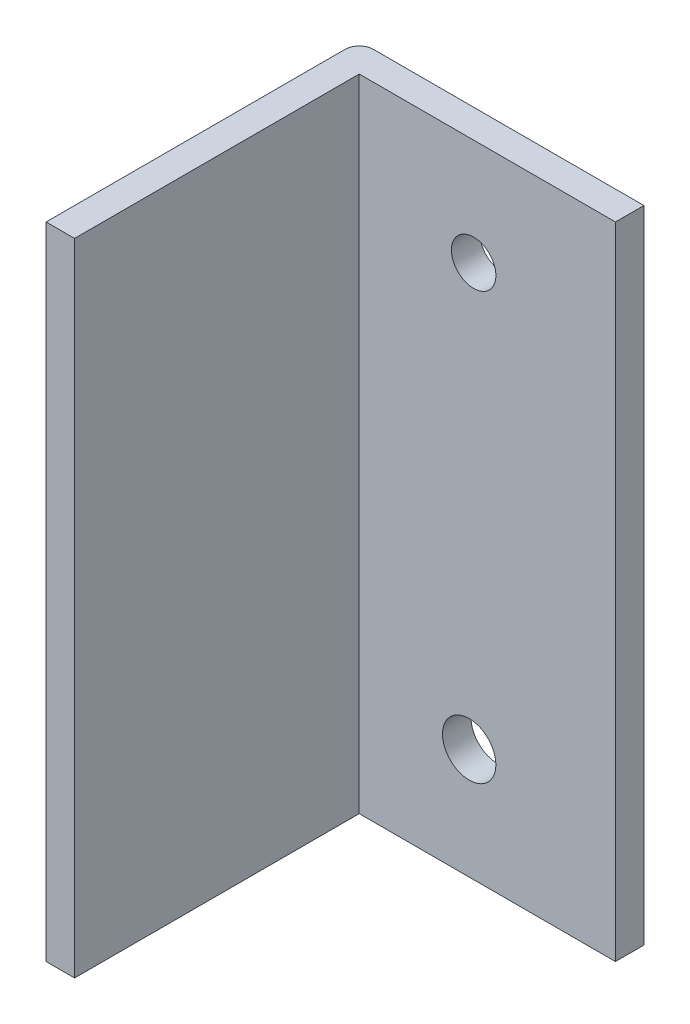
ISO-10303-21;
HEADER;
FILE_DESCRIPTION(('STEP AP214'),'2;1');
FILE_NAME('part.step','',(''),(''),'','','');
FILE_SCHEMA(('AUTOMOTIVE_DESIGN { 1 0 10303 214 1 1 1 1 }'));
ENDSEC;
DATA;
#1=APPLICATION_CONTEXT('core data for automotive mechanical design processes');
#2=APPLICATION_PROTOCOL_DEFINITION('international standard','automotive_design',2000,#1);
#3=PRODUCT_CONTEXT('',#1,'mechanical');
#4=PRODUCT('Part','Part','',(#3));
#5=PRODUCT_RELATED_PRODUCT_CATEGORY('part','',(#4));
#6=PRODUCT_DEFINITION_FORMATION('','',#4);
#7=PRODUCT_DEFINITION_CONTEXT('part definition',#1,'design');
#8=PRODUCT_DEFINITION('design','',#6,#7);
#9=PRODUCT_DEFINITION_SHAPE('','',#8);
#10=(LENGTH_UNIT() NAMED_UNIT(*) SI_UNIT(.MILLI.,.METRE.));
#11=(NAMED_UNIT(*) PLANE_ANGLE_UNIT() SI_UNIT($,.RADIAN.));
#12=(NAMED_UNIT(*) SI_UNIT($,.STERADIAN.) SOLID_ANGLE_UNIT());
#13=UNCERTAINTY_MEASURE_WITH_UNIT(LENGTH_MEASURE(1.E-05),#10,'distance_accuracy_value','');
#14=(GEOMETRIC_REPRESENTATION_CONTEXT(3) GLOBAL_UNCERTAINTY_ASSIGNED_CONTEXT((#13)) GLOBAL_UNIT_ASSIGNED_CONTEXT((#10,
#11,#12)) REPRESENTATION_CONTEXT('',''));
#15=CARTESIAN_POINT('',(0.,0.,0.));
#16=DIRECTION('',(0.,0.,1.));
#17=DIRECTION('',(1.,0.,0.));
#18=AXIS2_PLACEMENT_3D('',#15,#16,#17);
#19=CARTESIAN_POINT('',(25.4,-57.15,5.08));
#20=DIRECTION('',(-1.,0.,0.));
#21=DIRECTION('',(0.,0.,1.));
#22=AXIS2_PLACEMENT_3D('',#19,#20,#21);
#23=PLANE('',#22);
#24=DIRECTION('',(0.,1.,0.));
#25=VECTOR('',#24,1.);
#26=CARTESIAN_POINT('',(25.4,-57.15,0.));
#27=LINE('',#26,#25);
#28=CARTESIAN_POINT('',(25.4,-57.15,0.));
#29=VERTEX_POINT('',#28);
#30=CARTESIAN_POINT('',(25.4,57.15,0.));
#31=VERTEX_POINT('',#30);
#32=EDGE_CURVE('E120',#29,#31,#27,.T.);
#33=ORIENTED_EDGE('',*,*,#32,.T.);
#34=DIRECTION('',(0.,0.,-1.));
#35=VECTOR('',#34,1.);
#36=CARTESIAN_POINT('',(25.4,57.15,5.08));
#37=LINE('',#36,#35);
#38=CARTESIAN_POINT('',(25.4,57.15,5.08));
#39=VERTEX_POINT('',#38);
#40=EDGE_CURVE('E143',#39,#31,#37,.T.);
#41=ORIENTED_EDGE('',*,*,#40,.F.);
#42=DIRECTION('',(0.,1.,0.));
#43=VECTOR('',#42,1.);
#44=CARTESIAN_POINT('',(25.4,-57.15,5.08));
#45=LINE('',#44,#43);
#46=CARTESIAN_POINT('',(25.4,-57.15,5.08));
#47=VERTEX_POINT('',#46);
#48=EDGE_CURVE('E122',#47,#39,#45,.T.);
#49=ORIENTED_EDGE('',*,*,#48,.F.);
#50=DIRECTION('',(0.,0.,-1.));
#51=VECTOR('',#50,1.);
#52=CARTESIAN_POINT('',(25.4,-57.15,5.08));
#53=LINE('',#52,#51);
#54=EDGE_CURVE('E130',#47,#29,#53,.T.);
#55=ORIENTED_EDGE('',*,*,#54,.T.);
#56=EDGE_LOOP('',(#33,#41,#49,#55));
#57=FACE_BOUND('',#56,.T.);
#58=ADVANCED_FACE('F32',(#57),#23,.F.);
#59=CARTESIAN_POINT('',(-25.4,57.15,5.08));
#60=DIRECTION('',(0.,-1.,0.));
#61=DIRECTION('',(0.,0.,-1.));
#62=AXIS2_PLACEMENT_3D('',#59,#60,#61);
#63=PLANE('',#62);
#64=DIRECTION('',(-1.,0.,0.));
#65=VECTOR('',#64,1.);
#66=CARTESIAN_POINT('',(-25.4,57.15,0.));
#67=LINE('',#66,#65);
#68=CARTESIAN_POINT('',(-22.86,57.15,0.));
#69=VERTEX_POINT('',#68);
#70=EDGE_CURVE('E133',#31,#69,#67,.T.);
#71=ORIENTED_EDGE('',*,*,#70,.T.);
#72=CARTESIAN_POINT('',(-22.86,57.15,2.54));
#73=DIRECTION('',(0.,-1.,0.));
#74=DIRECTION('',(0.,0.,-1.));
#75=AXIS2_PLACEMENT_3D('',#72,#73,#74);
#76=CIRCLE('',#75,2.54);
#77=CARTESIAN_POINT('',(-25.4,57.15,2.54));
#78=VERTEX_POINT('',#77);
#79=EDGE_CURVE('E11',#69,#78,#76,.F.);
#80=ORIENTED_EDGE('',*,*,#79,.T.);
#81=DIRECTION('',(0.,0.,-1.));
#82=VECTOR('',#81,1.);
#83=CARTESIAN_POINT('',(-25.4,57.15,5.08));
#84=LINE('',#83,#82);
#85=CARTESIAN_POINT('',(-25.4,57.15,55.88));
#86=VERTEX_POINT('',#85);
#87=EDGE_CURVE('E140',#86,#78,#84,.T.);
#88=ORIENTED_EDGE('',*,*,#87,.F.);
#89=DIRECTION('',(-1.,0.,0.));
#90=VECTOR('',#89,1.);
#91=CARTESIAN_POINT('',(-20.32,57.15,55.88));
#92=LINE('',#91,#90);
#93=CARTESIAN_POINT('',(-20.32,57.15,55.88));
#94=VERTEX_POINT('',#93);
#95=EDGE_CURVE('E99',#94,#86,#92,.T.);
#96=ORIENTED_EDGE('',*,*,#95,.F.);
#97=DIRECTION('',(0.,0.,-1.));
#98=VECTOR('',#97,1.);
#99=CARTESIAN_POINT('',(-20.32,57.15,5.08));
#100=LINE('',#99,#98);
#101=CARTESIAN_POINT('',(-20.32,57.15,5.08));
#102=VERTEX_POINT('',#101);
#103=EDGE_CURVE('E100',#94,#102,#100,.T.);
#104=ORIENTED_EDGE('',*,*,#103,.T.);
#105=DIRECTION('',(-1.,0.,0.));
#106=VECTOR('',#105,1.);
#107=CARTESIAN_POINT('',(-25.4,57.15,5.08));
#108=LINE('',#107,#106);
#109=EDGE_CURVE('E125',#39,#102,#108,.T.);
#110=ORIENTED_EDGE('',*,*,#109,.F.);
#111=ORIENTED_EDGE('',*,*,#40,.T.);
#112=EDGE_LOOP('',(#71,#80,#88,#96,#104,#110,#111));
#113=FACE_BOUND('',#112,.T.);
#114=ADVANCED_FACE('F155',(#113),#63,.F.);
#115=CARTESIAN_POINT('',(-25.4,-57.15,5.08));
#116=DIRECTION('',(1.,0.,0.));
#117=DIRECTION('',(0.,0.,-1.));
#118=AXIS2_PLACEMENT_3D('',#115,#116,#117);
#119=PLANE('',#118);
#120=ORIENTED_EDGE('',*,*,#87,.T.);
#121=DIRECTION('',(0.,-1.,0.));
#122=VECTOR('',#121,1.);
#123=CARTESIAN_POINT('',(-25.4,-57.15,2.54));
#124=LINE('',#123,#122);
#125=CARTESIAN_POINT('',(-25.4,-57.15,2.54));
#126=VERTEX_POINT('',#125);
#127=EDGE_CURVE('E146',#78,#126,#124,.T.);
#128=ORIENTED_EDGE('',*,*,#127,.T.);
#129=DIRECTION('',(0.,0.,-1.));
#130=VECTOR('',#129,1.);
#131=CARTESIAN_POINT('',(-25.4,-57.15,5.08));
#132=LINE('',#131,#130);
#133=CARTESIAN_POINT('',(-25.4,-57.15,55.88));
#134=VERTEX_POINT('',#133);
#135=EDGE_CURVE('E138',#134,#126,#132,.T.);
#136=ORIENTED_EDGE('',*,*,#135,.F.);
#137=DIRECTION('',(0.,1.,0.));
#138=VECTOR('',#137,1.);
#139=CARTESIAN_POINT('',(-25.4,57.15,55.88));
#140=LINE('',#139,#138);
#141=EDGE_CURVE('E97',#134,#86,#140,.T.);
#142=ORIENTED_EDGE('',*,*,#141,.T.);
#143=EDGE_LOOP('',(#120,#128,#136,#142));
#144=FACE_BOUND('',#143,.T.);
#145=ADVANCED_FACE('F151',(#144),#119,.F.);
#146=CARTESIAN_POINT('',(-25.4,-57.15,5.08));
#147=DIRECTION('',(0.,1.,0.));
#148=DIRECTION('',(0.,0.,1.));
#149=AXIS2_PLACEMENT_3D('',#146,#147,#148);
#150=PLANE('',#149);
#151=ORIENTED_EDGE('',*,*,#135,.T.);
#152=CARTESIAN_POINT('',(-22.86,-57.15,2.54));
#153=DIRECTION('',(0.,1.,0.));
#154=DIRECTION('',(0.,0.,1.));
#155=AXIS2_PLACEMENT_3D('',#152,#153,#154);
#156=CIRCLE('',#155,2.54);
#157=CARTESIAN_POINT('',(-22.86,-57.15,0.));
#158=VERTEX_POINT('',#157);
#159=EDGE_CURVE('E54',#126,#158,#156,.F.);
#160=ORIENTED_EDGE('',*,*,#159,.T.);
#161=DIRECTION('',(1.,0.,0.));
#162=VECTOR('',#161,1.);
#163=CARTESIAN_POINT('',(-25.4,-57.15,0.));
#164=LINE('',#163,#162);
#165=EDGE_CURVE('E126',#158,#29,#164,.T.);
#166=ORIENTED_EDGE('',*,*,#165,.T.);
#167=ORIENTED_EDGE('',*,*,#54,.F.);
#168=DIRECTION('',(1.,0.,0.));
#169=VECTOR('',#168,1.);
#170=CARTESIAN_POINT('',(-25.4,-57.15,5.08));
#171=LINE('',#170,#169);
#172=CARTESIAN_POINT('',(-20.32,-57.15,5.08));
#173=VERTEX_POINT('',#172);
#174=EDGE_CURVE('E111',#173,#47,#171,.T.);
#175=ORIENTED_EDGE('',*,*,#174,.F.);
#176=DIRECTION('',(0.,0.,1.));
#177=VECTOR('',#176,1.);
#178=CARTESIAN_POINT('',(-20.32,-57.15,55.88));
#179=LINE('',#178,#177);
#180=CARTESIAN_POINT('',(-20.32,-57.15,55.88));
#181=VERTEX_POINT('',#180);
#182=EDGE_CURVE('E104',#173,#181,#179,.T.);
#183=ORIENTED_EDGE('',*,*,#182,.T.);
#184=DIRECTION('',(-1.,0.,0.));
#185=VECTOR('',#184,1.);
#186=CARTESIAN_POINT('',(-20.32,-57.15,55.88));
#187=LINE('',#186,#185);
#188=EDGE_CURVE('E90',#181,#134,#187,.T.);
#189=ORIENTED_EDGE('',*,*,#188,.T.);
#190=EDGE_LOOP('',(#151,#160,#166,#167,#175,#183,#189));
#191=FACE_BOUND('',#190,.T.);
#192=ADVANCED_FACE('F109',(#191),#150,.F.);
#193=CARTESIAN_POINT('',(0.,0.,5.08));
#194=DIRECTION('',(0.,0.,-1.));
#195=DIRECTION('',(-1.,0.,0.));
#196=AXIS2_PLACEMENT_3D('',#193,#194,#195);
#197=PLANE('',#196);
#198=CARTESIAN_POINT('',(0.0952499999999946,38.19525,5.08));
#199=DIRECTION('',(0.,0.,1.));
#200=DIRECTION('',(1.,0.,0.));
#201=AXIS2_PLACEMENT_3D('',#198,#199,#200);
#202=CIRCLE('',#201,3.96875);
#203=CARTESIAN_POINT('',(4.064,38.19525,5.08));
#204=VERTEX_POINT('',#203);
#205=EDGE_CURVE('E270',#204,#204,#202,.T.);
#206=ORIENTED_EDGE('',*,*,#205,.F.);
#207=EDGE_LOOP('',(#206));
#208=FACE_BOUND('',#207,.T.);
#209=CARTESIAN_POINT('',(-0.698500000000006,-37.4015,5.08));
#210=DIRECTION('',(0.,0.,1.));
#211=DIRECTION('',(1.,0.,0.));
#212=AXIS2_PLACEMENT_3D('',#209,#210,#211);
#213=CIRCLE('',#212,4.7625);
#214=CARTESIAN_POINT('',(4.06399999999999,-37.4015,5.08));
#215=VERTEX_POINT('',#214);
#216=EDGE_CURVE('E271',#215,#215,#213,.T.);
#217=ORIENTED_EDGE('',*,*,#216,.F.);
#218=EDGE_LOOP('',(#217));
#219=FACE_BOUND('',#218,.T.);
#220=ORIENTED_EDGE('',*,*,#109,.T.);
#221=DIRECTION('',(0.,-1.,0.));
#222=VECTOR('',#221,1.);
#223=CARTESIAN_POINT('',(-20.32,-57.15,5.08));
#224=LINE('',#223,#222);
#225=EDGE_CURVE('E112',#102,#173,#224,.T.);
#226=ORIENTED_EDGE('',*,*,#225,.T.);
#227=ORIENTED_EDGE('',*,*,#174,.T.);
#228=ORIENTED_EDGE('',*,*,#48,.T.);
#229=EDGE_LOOP('',(#220,#226,#227,#228));
#230=FACE_BOUND('',#229,.T.);
#231=ADVANCED_FACE('F162',(#208,#219,#230),#197,.F.);
#232=CARTESIAN_POINT('',(0.,0.,0.));
#233=DIRECTION('',(0.,0.,-1.));
#234=DIRECTION('',(-1.,0.,0.));
#235=AXIS2_PLACEMENT_3D('',#232,#233,#234);
#236=PLANE('',#235);
#237=CARTESIAN_POINT('',(0.0952499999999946,38.19525,0.));
#238=DIRECTION('',(0.,0.,1.));
#239=DIRECTION('',(1.,0.,0.));
#240=AXIS2_PLACEMENT_3D('',#237,#238,#239);
#241=CIRCLE('',#240,3.96875);
#242=CARTESIAN_POINT('',(4.064,38.19525,0.));
#243=VERTEX_POINT('',#242);
#244=EDGE_CURVE('E119',#243,#243,#241,.T.);
#245=ORIENTED_EDGE('',*,*,#244,.T.);
#246=EDGE_LOOP('',(#245));
#247=FACE_BOUND('',#246,.T.);
#248=CARTESIAN_POINT('',(-0.698500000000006,-37.4015,0.));
#249=DIRECTION('',(0.,0.,1.));
#250=DIRECTION('',(1.,0.,0.));
#251=AXIS2_PLACEMENT_3D('',#248,#249,#250);
#252=CIRCLE('',#251,4.7625);
#253=CARTESIAN_POINT('',(4.06399999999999,-37.4015,0.));
#254=VERTEX_POINT('',#253);
#255=EDGE_CURVE('E275',#254,#254,#252,.T.);
#256=ORIENTED_EDGE('',*,*,#255,.T.);
#257=EDGE_LOOP('',(#256));
#258=FACE_BOUND('',#257,.T.);
#259=ORIENTED_EDGE('',*,*,#165,.F.);
#260=DIRECTION('',(0.,-1.,0.));
#261=VECTOR('',#260,1.);
#262=CARTESIAN_POINT('',(-22.86,57.15,0.));
#263=LINE('',#262,#261);
#264=EDGE_CURVE('E40',#158,#69,#263,.F.);
#265=ORIENTED_EDGE('',*,*,#264,.T.);
#266=ORIENTED_EDGE('',*,*,#70,.F.);
#267=ORIENTED_EDGE('',*,*,#32,.F.);
#268=EDGE_LOOP('',(#259,#265,#266,#267));
#269=FACE_BOUND('',#268,.T.);
#270=ADVANCED_FACE('F158',(#247,#258,#269),#236,.T.);
#271=CARTESIAN_POINT('',(-20.32,57.15,55.88));
#272=DIRECTION('',(0.,0.,1.));
#273=DIRECTION('',(0.,-1.,0.));
#274=AXIS2_PLACEMENT_3D('',#271,#272,#273);
#275=PLANE('',#274);
#276=ORIENTED_EDGE('',*,*,#141,.F.);
#277=ORIENTED_EDGE('',*,*,#188,.F.);
#278=DIRECTION('',(0.,1.,0.));
#279=VECTOR('',#278,1.);
#280=CARTESIAN_POINT('',(-20.32,57.15,55.88));
#281=LINE('',#280,#279);
#282=EDGE_CURVE('E94',#181,#94,#281,.T.);
#283=ORIENTED_EDGE('',*,*,#282,.T.);
#284=ORIENTED_EDGE('',*,*,#95,.T.);
#285=EDGE_LOOP('',(#276,#277,#283,#284));
#286=FACE_BOUND('',#285,.T.);
#287=ADVANCED_FACE('F92',(#286),#275,.T.);
#288=CARTESIAN_POINT('',(-20.32,0.,0.));
#289=DIRECTION('',(1.,0.,0.));
#290=DIRECTION('',(0.,0.,-1.));
#291=AXIS2_PLACEMENT_3D('',#288,#289,#290);
#292=PLANE('',#291);
#293=ORIENTED_EDGE('',*,*,#225,.F.);
#294=ORIENTED_EDGE('',*,*,#103,.F.);
#295=ORIENTED_EDGE('',*,*,#282,.F.);
#296=ORIENTED_EDGE('',*,*,#182,.F.);
#297=EDGE_LOOP('',(#293,#294,#295,#296));
#298=FACE_BOUND('',#297,.T.);
#299=ADVANCED_FACE('F103',(#298),#292,.T.);
#300=CARTESIAN_POINT('',(-22.86,-57.15,2.54));
#301=DIRECTION('',(0.,1.,0.));
#302=DIRECTION('',(0.,0.,1.));
#303=AXIS2_PLACEMENT_3D('',#300,#301,#302);
#304=CYLINDRICAL_SURFACE('',#303,2.54);
#305=ORIENTED_EDGE('',*,*,#79,.F.);
#306=ORIENTED_EDGE('',*,*,#264,.F.);
#307=ORIENTED_EDGE('',*,*,#159,.F.);
#308=ORIENTED_EDGE('',*,*,#127,.F.);
#309=EDGE_LOOP('',(#305,#306,#307,#308));
#310=FACE_BOUND('',#309,.T.);
#311=ADVANCED_FACE('F34',(#310),#304,.T.);
#312=CARTESIAN_POINT('',(-0.698500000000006,-37.4015,0.));
#313=DIRECTION('',(0.,0.,1.));
#314=DIRECTION('',(1.,0.,0.));
#315=AXIS2_PLACEMENT_3D('',#312,#313,#314);
#316=CYLINDRICAL_SURFACE('',#315,4.7625);
#317=ORIENTED_EDGE('',*,*,#255,.F.);
#318=EDGE_LOOP('',(#317));
#319=FACE_BOUND('',#318,.T.);
#320=ORIENTED_EDGE('',*,*,#216,.T.);
#321=EDGE_LOOP('',(#320));
#322=FACE_BOUND('',#321,.T.);
#323=ADVANCED_FACE('F201',(#319,#322),#316,.F.);
#324=CARTESIAN_POINT('',(0.0952499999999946,38.19525,0.));
#325=DIRECTION('',(0.,0.,1.));
#326=DIRECTION('',(1.,0.,0.));
#327=AXIS2_PLACEMENT_3D('',#324,#325,#326);
#328=CYLINDRICAL_SURFACE('',#327,3.96875);
#329=ORIENTED_EDGE('',*,*,#244,.F.);
#330=EDGE_LOOP('',(#329));
#331=FACE_BOUND('',#330,.T.);
#332=ORIENTED_EDGE('',*,*,#205,.T.);
#333=EDGE_LOOP('',(#332));
#334=FACE_BOUND('',#333,.T.);
#335=ADVANCED_FACE('F224',(#331,#334),#328,.F.);
#336=CLOSED_SHELL('',(#58,#114,#145,#192,#231,#270,#287,#299,#311,#323,#335));
#337=MANIFOLD_SOLID_BREP('B2',#336);
#338=ADVANCED_BREP_SHAPE_REPRESENTATION('',(#18,#337),#14);
#339=SHAPE_DEFINITION_REPRESENTATION(#9,#338);
ENDSEC;
END-ISO-10303-21;
